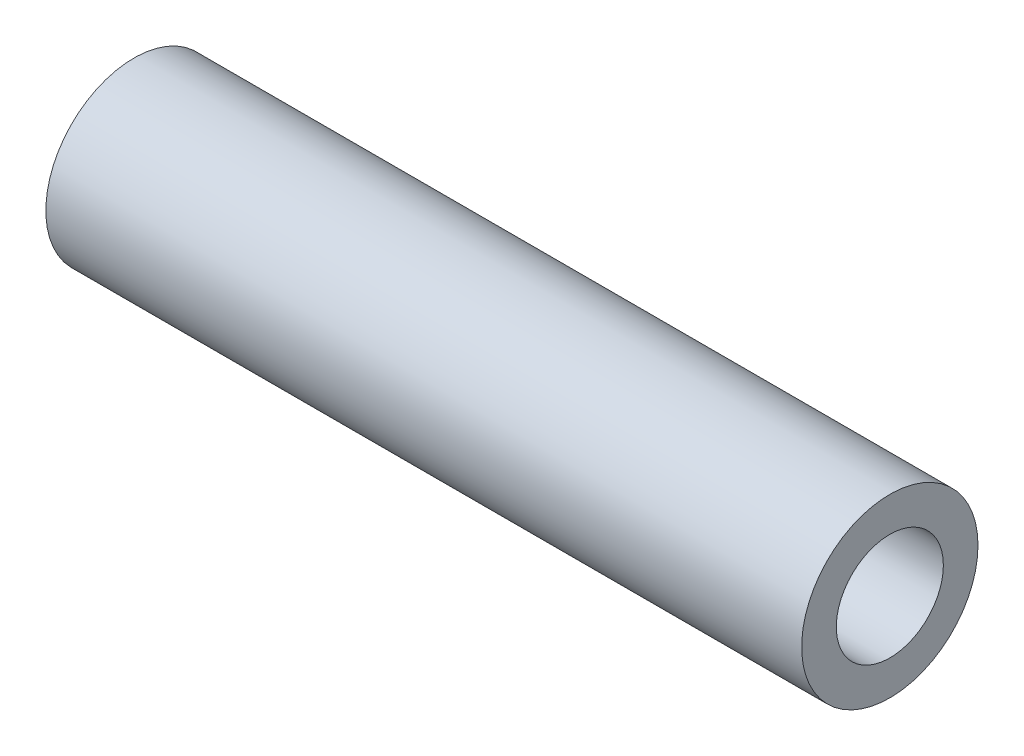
from build123d import *

# Parameters (mm, degrees)
ESQUISSE1_W = 60
ESQUISSE1_H = 2.75


with BuildPart() as part:
    # Esquisse1 → Base-R_volution (revolve)
    with BuildSketch(Plane.XY, mode=Mode.PRIVATE) as base_r_volution_sk:
        with Locations((-287.5, 5.625)):
            Rectangle(ESQUISSE1_W, ESQUISSE1_H)
    revolve(base_r_volution_sk.sketch.rotate(Axis((0, 0, 0), (-1, 0, 0)), 90), axis=Axis((0, 0, 0), (-1, 0, 0)))


solid = part.part
